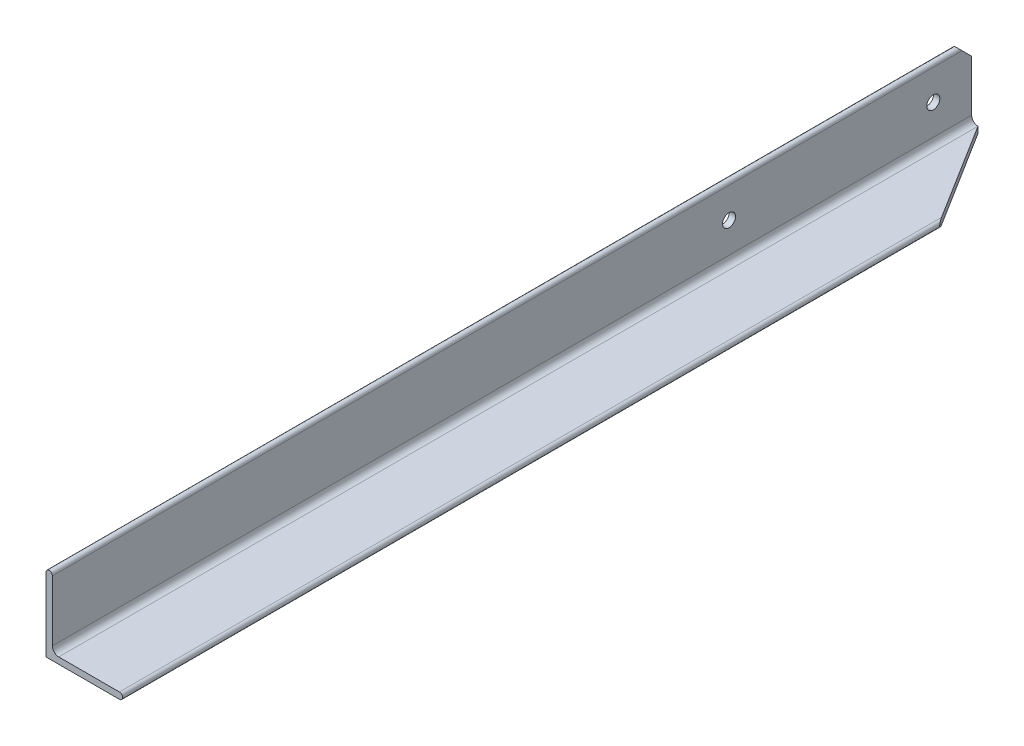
from build123d import *

# Parameters (mm, degrees)
BOSS_EXTRUDE1_DEPTH = 228.6
SKETCH5_R           = 3.2385
CUT_EXTRUDE3_DEPTH  = 235.370061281
CUT_EXTRUDE4_DEPTH  = 235.370061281


with BuildPart() as part:
    # Sketch1 → Boss-Extrude1 (new, symmetric)
    with BuildSketch(Plane.XY):
        with BuildLine():
            Line((0, 0), (0, 36.5125))
            ThreePointArc((0, 36.5125), (1.5875, 38.1), (3.175, 36.5125))
            Line((3.175, 36.5125), (3.175, 6.35))
            ThreePointArc((3.175, 6.35), (4.10493597, 4.10493597), (6.35, 3.175))
            Line((6.35, 3.175), (36.5125, 3.175))
            ThreePointArc((36.5125, 3.175), (38.1, 1.5875), (36.5125, 0))
            Line((36.5125, 0), (0, 0))
        make_face()
    extrude(amount=BOSS_EXTRUDE1_DEPTH, both=True)

    # Sketch5 → Cut-Extrude3 (cut, through all)
    with BuildSketch(Plane(origin=(3.175, 0, 0), x_dir=(0, 0, -1), z_dir=(1, 0, 0))):
        with Locations((209.55, 21.43125)):
            Circle(SKETCH5_R)
        with Locations((107.95, 21.43125)):
            Circle(SKETCH5_R)
        Polygon((228.6, 38.1), (228.6, 31.75), (222.25, 38.1), align=None)
    extrude(amount=-CUT_EXTRUDE3_DEPTH, mode=Mode.SUBTRACT)

    # Sketch6 → Cut-Extrude4 (cut, through all)
    with BuildSketch(Plane(origin=(0, 3.175, 0), x_dir=(1, 0, 0), z_dir=(0, 1, 0))):
        Polygon((38.1, 228.6), (6.35, 228.6), (38.1, 177.8), align=None)
    extrude(amount=-CUT_EXTRUDE4_DEPTH, mode=Mode.SUBTRACT)


solid = part.part
